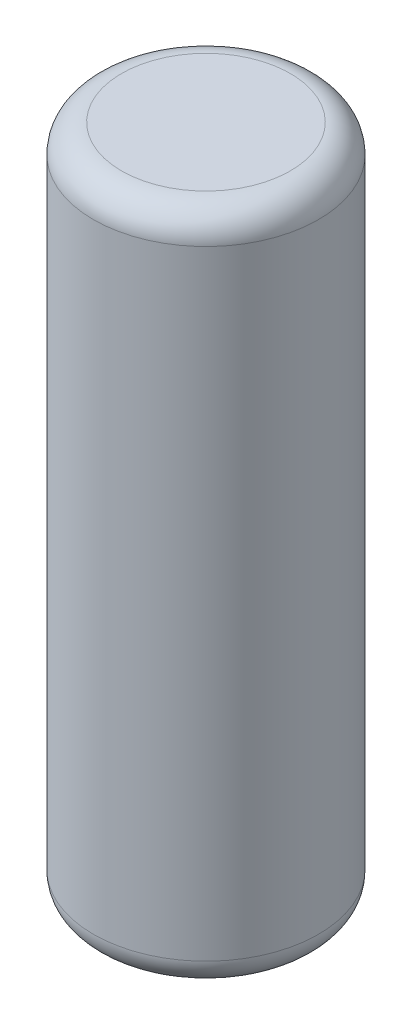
ISO-10303-21;
HEADER;
FILE_DESCRIPTION(('STEP AP214'),'2;1');
FILE_NAME('part.step','',(''),(''),'','','');
FILE_SCHEMA(('AUTOMOTIVE_DESIGN { 1 0 10303 214 1 1 1 1 }'));
ENDSEC;
DATA;
#1=APPLICATION_CONTEXT('core data for automotive mechanical design processes');
#2=APPLICATION_PROTOCOL_DEFINITION('international standard','automotive_design',2000,#1);
#3=PRODUCT_CONTEXT('',#1,'mechanical');
#4=PRODUCT('Part','Part','',(#3));
#5=PRODUCT_RELATED_PRODUCT_CATEGORY('part','',(#4));
#6=PRODUCT_DEFINITION_FORMATION('','',#4);
#7=PRODUCT_DEFINITION_CONTEXT('part definition',#1,'design');
#8=PRODUCT_DEFINITION('design','',#6,#7);
#9=PRODUCT_DEFINITION_SHAPE('','',#8);
#10=(LENGTH_UNIT() NAMED_UNIT(*) SI_UNIT(.MILLI.,.METRE.));
#11=(NAMED_UNIT(*) PLANE_ANGLE_UNIT() SI_UNIT($,.RADIAN.));
#12=(NAMED_UNIT(*) SI_UNIT($,.STERADIAN.) SOLID_ANGLE_UNIT());
#13=UNCERTAINTY_MEASURE_WITH_UNIT(LENGTH_MEASURE(1.E-05),#10,'distance_accuracy_value','');
#14=(GEOMETRIC_REPRESENTATION_CONTEXT(3) GLOBAL_UNCERTAINTY_ASSIGNED_CONTEXT((#13)) GLOBAL_UNIT_ASSIGNED_CONTEXT((#10,
#11,#12)) REPRESENTATION_CONTEXT('',''));
#15=CARTESIAN_POINT('',(0.,0.,0.));
#16=DIRECTION('',(0.,0.,1.));
#17=DIRECTION('',(1.,0.,0.));
#18=AXIS2_PLACEMENT_3D('',#15,#16,#17);
#19=CARTESIAN_POINT('',(0.,6.,0.));
#20=DIRECTION('',(0.,-1.,0.));
#21=DIRECTION('',(0.,0.,-1.));
#22=AXIS2_PLACEMENT_3D('',#19,#20,#21);
#23=CYLINDRICAL_SURFACE('',#22,2.);
#24=CARTESIAN_POINT('',(0.,-5.5,0.));
#25=DIRECTION('',(0.,1.,0.));
#26=DIRECTION('',(0.,0.,1.));
#27=AXIS2_PLACEMENT_3D('',#24,#25,#26);
#28=CIRCLE('',#27,2.);
#29=CARTESIAN_POINT('',(0.,-5.5,2.));
#30=VERTEX_POINT('',#29);
#31=EDGE_CURVE('E40',#30,#30,#28,.T.);
#32=ORIENTED_EDGE('',*,*,#31,.T.);
#33=EDGE_LOOP('',(#32));
#34=FACE_BOUND('',#33,.T.);
#35=CARTESIAN_POINT('',(0.,5.5,0.));
#36=DIRECTION('',(0.,1.,0.));
#37=DIRECTION('',(0.,0.,1.));
#38=AXIS2_PLACEMENT_3D('',#35,#36,#37);
#39=CIRCLE('',#38,2.);
#40=CARTESIAN_POINT('',(0.,5.5,2.));
#41=VERTEX_POINT('',#40);
#42=EDGE_CURVE('E44',#41,#41,#39,.F.);
#43=ORIENTED_EDGE('',*,*,#42,.T.);
#44=EDGE_LOOP('',(#43));
#45=FACE_BOUND('',#44,.T.);
#46=ADVANCED_FACE('F29',(#34,#45),#23,.T.);
#47=CARTESIAN_POINT('',(0.,6.,0.));
#48=DIRECTION('',(0.,1.,0.));
#49=DIRECTION('',(0.,0.,1.));
#50=AXIS2_PLACEMENT_3D('',#47,#48,#49);
#51=PLANE('',#50);
#52=CARTESIAN_POINT('',(0.,6.,0.));
#53=DIRECTION('',(0.,1.,0.));
#54=DIRECTION('',(0.,0.,1.));
#55=AXIS2_PLACEMENT_3D('',#52,#53,#54);
#56=CIRCLE('',#55,1.5);
#57=CARTESIAN_POINT('',(0.,6.,1.5));
#58=VERTEX_POINT('',#57);
#59=EDGE_CURVE('E10',#58,#58,#56,.T.);
#60=ORIENTED_EDGE('',*,*,#59,.T.);
#61=EDGE_LOOP('',(#60));
#62=FACE_BOUND('',#61,.T.);
#63=ADVANCED_FACE('F60',(#62),#51,.T.);
#64=CARTESIAN_POINT('',(0.,-6.,0.));
#65=DIRECTION('',(0.,1.,0.));
#66=DIRECTION('',(0.,0.,1.));
#67=AXIS2_PLACEMENT_3D('',#64,#65,#66);
#68=PLANE('',#67);
#69=CARTESIAN_POINT('',(0.,-6.,0.));
#70=DIRECTION('',(0.,1.,0.));
#71=DIRECTION('',(0.,0.,1.));
#72=AXIS2_PLACEMENT_3D('',#69,#70,#71);
#73=CIRCLE('',#72,1.5);
#74=CARTESIAN_POINT('',(0.,-6.,1.5));
#75=VERTEX_POINT('',#74);
#76=EDGE_CURVE('E36',#75,#75,#73,.F.);
#77=ORIENTED_EDGE('',*,*,#76,.T.);
#78=EDGE_LOOP('',(#77));
#79=FACE_BOUND('',#78,.T.);
#80=ADVANCED_FACE('F57',(#79),#68,.F.);
#81=CARTESIAN_POINT('',(0.,-5.5,0.));
#82=DIRECTION('',(0.,1.,0.));
#83=DIRECTION('',(0.,0.,1.));
#84=AXIS2_PLACEMENT_3D('',#81,#82,#83);
#85=TOROIDAL_SURFACE('',#84,1.5,0.5);
#86=ORIENTED_EDGE('',*,*,#76,.F.);
#87=EDGE_LOOP('',(#86));
#88=FACE_BOUND('',#87,.T.);
#89=ORIENTED_EDGE('',*,*,#31,.F.);
#90=EDGE_LOOP('',(#89));
#91=FACE_BOUND('',#90,.T.);
#92=ADVANCED_FACE('F53',(#88,#91),#85,.T.);
#93=CARTESIAN_POINT('',(0.,5.5,0.));
#94=DIRECTION('',(0.,1.,0.));
#95=DIRECTION('',(0.,0.,1.));
#96=AXIS2_PLACEMENT_3D('',#93,#94,#95);
#97=TOROIDAL_SURFACE('',#96,1.5,0.5);
#98=ORIENTED_EDGE('',*,*,#42,.F.);
#99=EDGE_LOOP('',(#98));
#100=FACE_BOUND('',#99,.T.);
#101=ORIENTED_EDGE('',*,*,#59,.F.);
#102=EDGE_LOOP('',(#101));
#103=FACE_BOUND('',#102,.T.);
#104=ADVANCED_FACE('F31',(#100,#103),#97,.T.);
#105=CLOSED_SHELL('',(#46,#63,#80,#92,#104));
#106=MANIFOLD_SOLID_BREP('B2',#105);
#107=ADVANCED_BREP_SHAPE_REPRESENTATION('',(#18,#106),#14);
#108=SHAPE_DEFINITION_REPRESENTATION(#9,#107);
ENDSEC;
END-ISO-10303-21;
